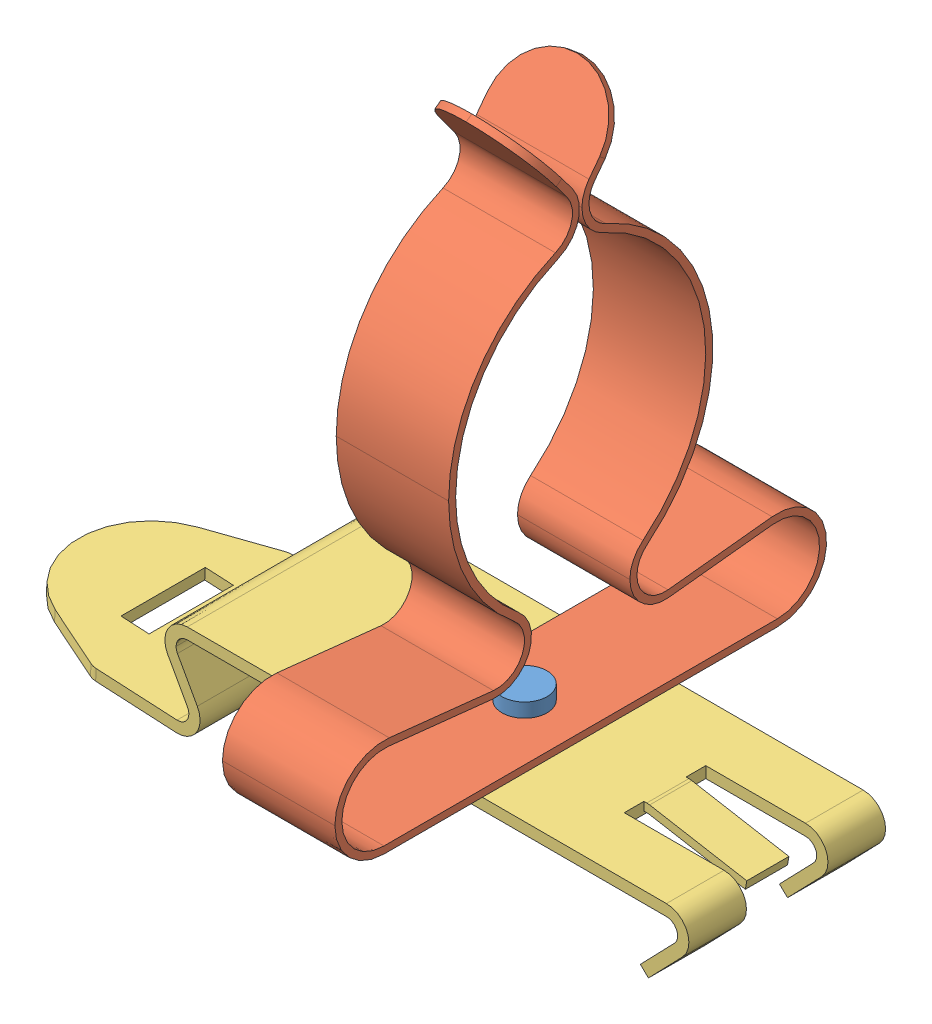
SolidWorks assembly 36249.SLDASM, configuration Default (file format 8000). Lengths in mm.
Overall size (50.45 45.41 35).
3 component instances, 3 part files, 0 mates.
Components (placement in the parent):
- 36249_01-1: 36249_01.SLDPRT [Default] at origin size (6 3.3 6)
- 36249_02-1: 36249_02.SLDPRT [Default] at origin size (8 38.5 35)
- 36249_03-1: 36249_03.SLDPRT [Default] at origin size (50.45 6.91 14)
